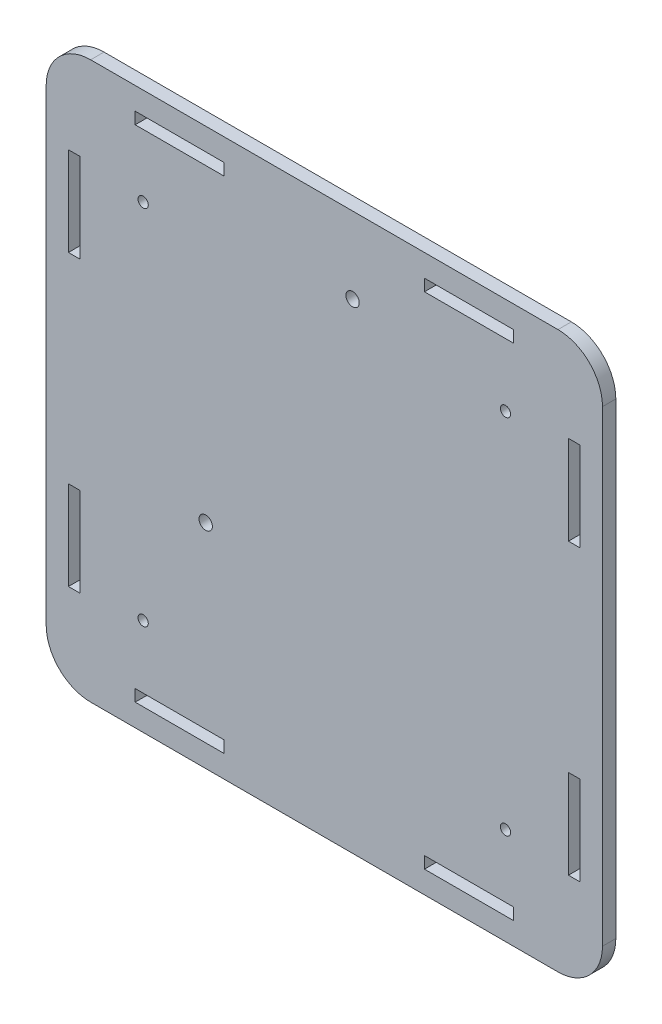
from build123d import *

# Parameters (mm, degrees)
CROQUIS1_W              = 125
CROQUIS1_H              = 125
SALIENTE_EXTRUIR1_DEPTH = 3
REDONDEO1_R             = 10
CROQUIS2_W              = 2.65
CROQUIS2_H              = 20
CROQUIS2_W_2            = 20
CROQUIS2_H_2            = 2.65
CORTAR_EXTRUIR1_DEPTH   = 3
CORTAR_EXTRUIR3_REACH   = 178.802
CROQUIS4_R              = 1.5
CORTAR_EXTRUIR5_REACH   = 178.802
CROQUIS7_R              = 1.15


with BuildPart() as part:
    # Croquis1 → Saliente-Extruir1 (new body)
    with BuildSketch(Plane.XY):
        with Locations((62.5, 62.5)):
            Rectangle(CROQUIS1_W, CROQUIS1_H)
    extrude(amount=SALIENTE_EXTRUIR1_DEPTH)

    # Redondeo1
    redondeo1_edges = [part.edges().sort_by_distance(p)[0] for p in [
        (125, 0, 1.5),
        (0, 0, 1.5),
        (0, 125, 1.5),
        (125, 125, 1.5),
    ]]
    fillet(redondeo1_edges, radius=REDONDEO1_R)

    # Croquis2 → Cortar-Extruir1 (cut)
    with BuildSketch(Plane.XY.offset(3)):
        with Locations((6.325, 30)):
            Rectangle(CROQUIS2_W, CROQUIS2_H)
        with Locations((6.325, 95)):
            Rectangle(CROQUIS2_W, CROQUIS2_H)
        with Locations((118.675, 95)):
            Rectangle(CROQUIS2_W, CROQUIS2_H)
        with Locations((118.675, 30)):
            Rectangle(CROQUIS2_W, CROQUIS2_H)
        with Locations((95, 6.325)):
            Rectangle(CROQUIS2_W_2, CROQUIS2_H_2)
        with Locations((30, 6.325)):
            Rectangle(CROQUIS2_W_2, CROQUIS2_H_2)
        with Locations((95, 118.675)):
            Rectangle(CROQUIS2_W_2, CROQUIS2_H_2)
        with Locations((30, 118.675)):
            Rectangle(CROQUIS2_W_2, CROQUIS2_H_2)
    extrude(amount=-CORTAR_EXTRUIR1_DEPTH, mode=Mode.SUBTRACT)

    # Croquis4 → Cortar-Extruir3 (cut, up to next)
    with BuildSketch(Plane.XY.offset(3), mode=Mode.PRIVATE) as cortar_extruir3_sk1:
        with Locations((35.85, 47.85)):
            Circle(CROQUIS4_R)
    cortar_extruir3_tool1 = extrude(cortar_extruir3_sk1.sketch, amount=-CORTAR_EXTRUIR3_REACH, mode=Mode.PRIVATE) & part.part
    # Croquis4 → Cortar-Extruir3 (cut, up to next)
    with BuildSketch(Plane.XY.offset(3), mode=Mode.PRIVATE) as cortar_extruir3_sk2:
        with Locations((68.85, 107.85)):
            Circle(CROQUIS4_R)
    cortar_extruir3_tool2 = extrude(cortar_extruir3_sk2.sketch, amount=-CORTAR_EXTRUIR3_REACH, mode=Mode.PRIVATE) & part.part
    add(cortar_extruir3_tool1.solids().sort_by_distance((35.85, 47.85, 3))[0], mode=Mode.SUBTRACT)
    add(cortar_extruir3_tool2.solids().sort_by_distance((68.85, 107.85, 3))[0], mode=Mode.SUBTRACT)

    # Croquis7 → Cortar-Extruir5 (cut, up to next)
    with BuildSketch(Plane.XY.offset(3), mode=Mode.PRIVATE) as cortar_extruir5_sk1:
        with Locations((21.792135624, 103.207864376)):
            Circle(CROQUIS7_R)
    cortar_extruir5_tool1 = extrude(cortar_extruir5_sk1.sketch, amount=-CORTAR_EXTRUIR5_REACH, mode=Mode.PRIVATE) & part.part
    # Croquis7 → Cortar-Extruir5 (cut, up to next)
    with BuildSketch(Plane.XY.offset(3), mode=Mode.PRIVATE) as cortar_extruir5_sk2:
        with Locations((103.207864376, 103.207864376)):
            Circle(CROQUIS7_R)
    cortar_extruir5_tool2 = extrude(cortar_extruir5_sk2.sketch, amount=-CORTAR_EXTRUIR5_REACH, mode=Mode.PRIVATE) & part.part
    # Croquis7 → Cortar-Extruir5 (cut, up to next)
    with BuildSketch(Plane.XY.offset(3), mode=Mode.PRIVATE) as cortar_extruir5_sk3:
        with Locations((103.207864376, 21.792135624)):
            Circle(CROQUIS7_R)
    cortar_extruir5_tool3 = extrude(cortar_extruir5_sk3.sketch, amount=-CORTAR_EXTRUIR5_REACH, mode=Mode.PRIVATE) & part.part
    # Croquis7 → Cortar-Extruir5 (cut, up to next)
    with BuildSketch(Plane.XY.offset(3), mode=Mode.PRIVATE) as cortar_extruir5_sk4:
        with Locations((21.792135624, 21.792135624)):
            Circle(CROQUIS7_R)
    cortar_extruir5_tool4 = extrude(cortar_extruir5_sk4.sketch, amount=-CORTAR_EXTRUIR5_REACH, mode=Mode.PRIVATE) & part.part
    add(cortar_extruir5_tool1.solids().sort_by_distance((21.792136, 103.207864, 3))[0], mode=Mode.SUBTRACT)
    add(cortar_extruir5_tool2.solids().sort_by_distance((103.207864, 103.207864, 3))[0], mode=Mode.SUBTRACT)
    add(cortar_extruir5_tool3.solids().sort_by_distance((103.207864, 21.792136, 3))[0], mode=Mode.SUBTRACT)
    add(cortar_extruir5_tool4.solids().sort_by_distance((21.792136, 21.792136, 3))[0], mode=Mode.SUBTRACT)


solid = part.part
